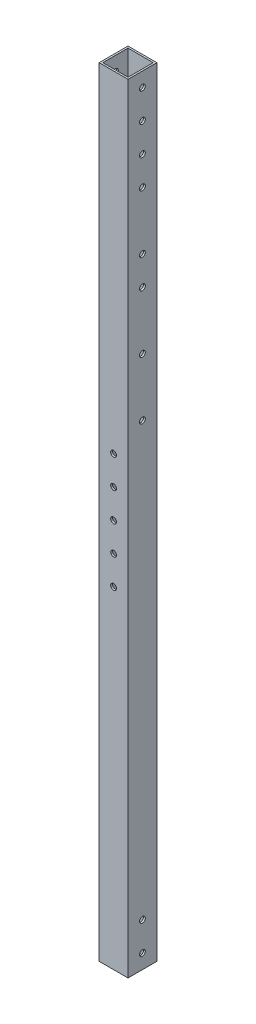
from build123d import *

# Parameters (mm, degrees)
SKETCH1_W                  = 25.4
SKETCH1_H                  = 25.4
SKETCH1_W_2                = 22.225
SKETCH1_H_2                = 22.225
BOSS_EXTRUDE1_DEPTH        = 685.8
F_7_0_201_DIAMETER_HOLE1_D = 5.1054
F_7_0_201_DIAMETER_HOLE2_D = 5.1054


with BuildPart() as part:
    # Sketch1 → Boss-Extrude1 (new body)
    with BuildSketch(Plane(origin=(0, 0, 0), x_dir=(1, 0, 0), z_dir=(0, 1, 0))):
        Rectangle(SKETCH1_W, SKETCH1_H)
        Rectangle(SKETCH1_W_2, SKETCH1_H_2, mode=Mode.SUBTRACT)
    extrude(amount=BOSS_EXTRUDE1_DEPTH)

    # 7 _0.201_ Diameter Hole1 (through all)
    with Locations(Plane.XY.offset(12.7)):
        with Locations((0, 292.1), (0, 317.5), (0, 342.9), (0, 368.3), (0, 393.7)):
            Hole(F_7_0_201_DIAMETER_HOLE1_D / 2)

    # 7 _0.201_ Diameter Hole2 (through all)
    with Locations(Plane(origin=(12.7, 0, 0), x_dir=(0, 0, -1), z_dir=(1, 0, 0))):
        with Locations((0, 12.7), (0, 38.1), (0, 622.3), (0, 647.7), (0, 673.1), (0, 596.9), (0, 546.1), (0, 520.7), (0, 469.9), (0, 419.1)):
            Hole(F_7_0_201_DIAMETER_HOLE2_D / 2)


solid = part.part
